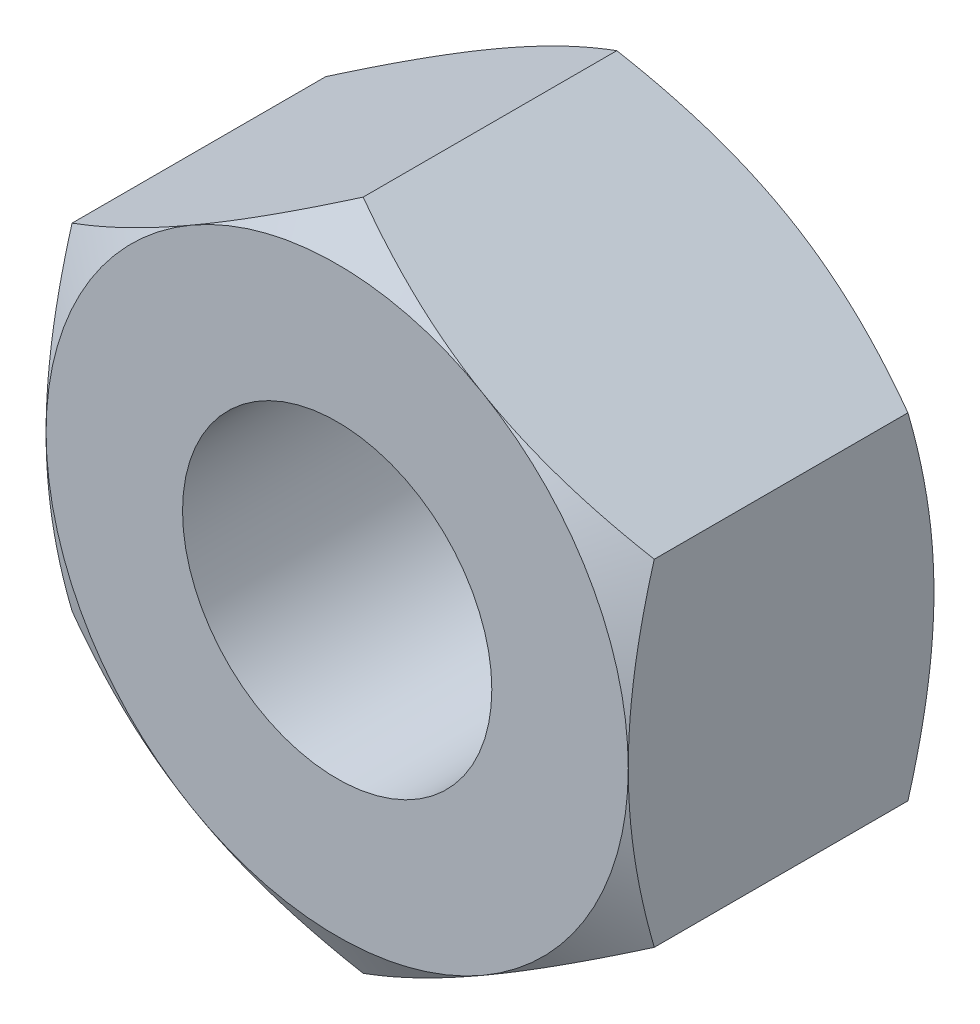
ISO-10303-21;
HEADER;
FILE_DESCRIPTION(('STEP AP214'),'2;1');
FILE_NAME('part.step','',(''),(''),'','','');
FILE_SCHEMA(('AUTOMOTIVE_DESIGN { 1 0 10303 214 1 1 1 1 }'));
ENDSEC;
DATA;
#1=APPLICATION_CONTEXT('core data for automotive mechanical design processes');
#2=APPLICATION_PROTOCOL_DEFINITION('international standard','automotive_design',2000,#1);
#3=PRODUCT_CONTEXT('',#1,'mechanical');
#4=PRODUCT('Part','Part','',(#3));
#5=PRODUCT_RELATED_PRODUCT_CATEGORY('part','',(#4));
#6=PRODUCT_DEFINITION_FORMATION('','',#4);
#7=PRODUCT_DEFINITION_CONTEXT('part definition',#1,'design');
#8=PRODUCT_DEFINITION('design','',#6,#7);
#9=PRODUCT_DEFINITION_SHAPE('','',#8);
#10=(LENGTH_UNIT() NAMED_UNIT(*) SI_UNIT(.MILLI.,.METRE.));
#11=(NAMED_UNIT(*) PLANE_ANGLE_UNIT() SI_UNIT($,.RADIAN.));
#12=(NAMED_UNIT(*) SI_UNIT($,.STERADIAN.) SOLID_ANGLE_UNIT());
#13=UNCERTAINTY_MEASURE_WITH_UNIT(LENGTH_MEASURE(1.E-05),#10,'distance_accuracy_value','');
#14=(GEOMETRIC_REPRESENTATION_CONTEXT(3) GLOBAL_UNCERTAINTY_ASSIGNED_CONTEXT((#13)) GLOBAL_UNIT_ASSIGNED_CONTEXT((#10,
#11,#12)) REPRESENTATION_CONTEXT('',''));
#15=CARTESIAN_POINT('',(0.,0.,0.));
#16=DIRECTION('',(0.,0.,1.));
#17=DIRECTION('',(1.,0.,0.));
#18=AXIS2_PLACEMENT_3D('',#15,#16,#17);
#19=CARTESIAN_POINT('',(8.,-4.618802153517,8.4));
#20=DIRECTION('',(-1.,0.,0.));
#21=DIRECTION('',(0.,-1.,0.));
#22=AXIS2_PLACEMENT_3D('',#19,#20,#21);
#23=PLANE('',#22);
#24=DIRECTION('',(0.,0.,-1.));
#25=VECTOR('',#24,1.);
#26=CARTESIAN_POINT('',(8.,4.61880215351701,8.4));
#27=LINE('',#26,#25);
#28=CARTESIAN_POINT('',(8.,4.61880215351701,7.68546882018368));
#29=VERTEX_POINT('',#28);
#30=CARTESIAN_POINT('',(8.,4.61880215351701,0.714531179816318));
#31=VERTEX_POINT('',#30);
#32=EDGE_CURVE('E150',#29,#31,#27,.T.);
#33=ORIENTED_EDGE('',*,*,#32,.F.);
#34=CARTESIAN_POINT('',(8.,-12.2497439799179,4.57178635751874));
#35=CARTESIAN_POINT('',(8.,-11.8984987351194,4.7415274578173));
#36=CARTESIAN_POINT('',(8.,-11.5464230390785,4.90958119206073));
#37=CARTESIAN_POINT('',(8.,-10.840161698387,5.24134970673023));
#38=CARTESIAN_POINT('',(8.,-10.4859757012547,5.40506373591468));
#39=CARTESIAN_POINT('',(8.,-9.77313142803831,5.72805107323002));
#40=CARTESIAN_POINT('',(8.,-9.41445915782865,5.88729360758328));
#41=CARTESIAN_POINT('',(8.,-8.69416671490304,6.1989388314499));
#42=CARTESIAN_POINT('',(8.,-8.33254669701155,6.35134187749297));
#43=CARTESIAN_POINT('',(8.,-7.60129405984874,6.64929869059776));
#44=CARTESIAN_POINT('',(8.,-7.23161757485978,6.79474539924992));
#45=CARTESIAN_POINT('',(8.,-6.48790521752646,7.07424757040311));
#46=CARTESIAN_POINT('',(8.,-6.11386886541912,7.20830176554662));
#47=CARTESIAN_POINT('',(8.,-5.36160531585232,7.46141638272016));
#48=CARTESIAN_POINT('',(8.,-4.9833889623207,7.58050868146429));
#49=CARTESIAN_POINT('',(8.,-4.22159300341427,7.79983373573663));
#50=CARTESIAN_POINT('',(8.,-3.83801513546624,7.9000724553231));
#51=CARTESIAN_POINT('',(8.,-3.06517005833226,8.07681673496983));
#52=CARTESIAN_POINT('',(8.,-2.67590136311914,8.15331597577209));
#53=CARTESIAN_POINT('',(8.,-2.0885729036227,8.24642984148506));
#54=CARTESIAN_POINT('',(8.,-1.89220175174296,8.27386398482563));
#55=CARTESIAN_POINT('',(8.,-1.49853877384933,8.3209808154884));
#56=CARTESIAN_POINT('',(8.,-1.30124704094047,8.34066427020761));
#57=CARTESIAN_POINT('',(8.,-0.907261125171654,8.37175001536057));
#58=CARTESIAN_POINT('',(8.,-0.710571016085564,8.38320372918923));
#59=CARTESIAN_POINT('',(8.,-0.316882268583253,8.39776943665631));
#60=CARTESIAN_POINT('',(8.,-0.119883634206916,8.40088153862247));
#61=CARTESIAN_POINT('',(8.,0.274012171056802,8.39868986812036));
#62=CARTESIAN_POINT('',(8.,0.470909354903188,8.39338845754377));
#63=CARTESIAN_POINT('',(8.,0.864308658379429,8.37450159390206));
#64=CARTESIAN_POINT('',(8.,1.06081075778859,8.3609157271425));
#65=CARTESIAN_POINT('',(8.,1.53707134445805,8.31823147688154));
#66=CARTESIAN_POINT('',(8.,1.81646391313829,8.28498228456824));
#67=CARTESIAN_POINT('',(8.,2.37310809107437,8.20358169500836));
#68=CARTESIAN_POINT('',(8.,2.65035909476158,8.15542623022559));
#69=CARTESIAN_POINT('',(8.,3.20249141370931,8.04592101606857));
#70=CARTESIAN_POINT('',(8.,3.4773702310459,7.98455879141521));
#71=CARTESIAN_POINT('',(8.,4.02429975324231,7.85051229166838));
#72=CARTESIAN_POINT('',(8.,4.29635072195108,7.77782908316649));
#73=CARTESIAN_POINT('',(8.,4.84432510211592,7.62097954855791));
#74=CARTESIAN_POINT('',(8.,5.1201799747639,7.53657541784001));
#75=CARTESIAN_POINT('',(8.,5.6689739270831,7.3594275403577));
#76=CARTESIAN_POINT('',(8.,5.94191487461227,7.26668954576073));
#77=CARTESIAN_POINT('',(8.,6.48378576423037,7.07478953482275));
#78=CARTESIAN_POINT('',(8.,6.7527296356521,6.97566661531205));
#79=CARTESIAN_POINT('',(8.,7.28853074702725,6.7716028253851));
#80=CARTESIAN_POINT('',(8.,7.55538709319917,6.66665960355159));
#81=CARTESIAN_POINT('',(8.,7.82127397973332,6.55938198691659));
#82=B_SPLINE_CURVE_WITH_KNOTS('',3,(#34,#35,#36,#37,#38,#39,#40,#41,#42,#43,#44,#45,#46,#47,#48,
#49,#50,#51,#52,#53,#54,#55,#56,#57,#58,#59,#60,#61,#62,#63,#64,#65,#66,#67,#68,#69,#70,#71,#72,
#73,#74,#75,#76,#77,#78,#79,#80,#81),.UNSPECIFIED.,.F.,.F.,(4,2,2,2,2,2,2,2,2,2,2,2,2,2,2,2,2,2,
2,2,2,2,2,4),(0.,1.17034358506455,2.34088846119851,3.51813189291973,4.69531388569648,
5.88694801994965,7.0787145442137,8.26789729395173,9.4567032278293,10.6458253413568,
11.2405311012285,11.8351779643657,12.4260760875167,13.0169665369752,13.6076911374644,
14.1984452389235,15.0420672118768,15.8859195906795,16.7305726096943,17.5751460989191,
18.4404219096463,19.3051050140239,20.1649211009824,21.0250871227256),.UNSPECIFIED.);
#83=CARTESIAN_POINT('',(8.,0.,8.4));
#84=VERTEX_POINT('',#83);
#85=EDGE_CURVE('E328',#29,#84,#82,.F.);
#86=ORIENTED_EDGE('',*,*,#85,.T.);
#87=CARTESIAN_POINT('',(8.,-4.618802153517,7.68546882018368));
#88=VERTEX_POINT('',#87);
#89=EDGE_CURVE('E323',#84,#88,#82,.F.);
#90=ORIENTED_EDGE('',*,*,#89,.T.);
#91=DIRECTION('',(0.,0.,-1.));
#92=VECTOR('',#91,1.);
#93=CARTESIAN_POINT('',(8.,-4.618802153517,8.4));
#94=LINE('',#93,#92);
#95=CARTESIAN_POINT('',(8.,-4.618802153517,0.714531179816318));
#96=VERTEX_POINT('',#95);
#97=EDGE_CURVE('E195',#88,#96,#94,.T.);
#98=ORIENTED_EDGE('',*,*,#97,.T.);
#99=CARTESIAN_POINT('',(8.,-12.2497439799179,3.82821364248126));
#100=CARTESIAN_POINT('',(8.,-11.8984987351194,3.6584725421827));
#101=CARTESIAN_POINT('',(8.,-11.5464230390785,3.49041880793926));
#102=CARTESIAN_POINT('',(8.,-10.840161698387,3.15865029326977));
#103=CARTESIAN_POINT('',(8.,-10.4859757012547,2.99493626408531));
#104=CARTESIAN_POINT('',(8.,-9.77313142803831,2.67194892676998));
#105=CARTESIAN_POINT('',(8.,-9.41445915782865,2.51270639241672));
#106=CARTESIAN_POINT('',(8.,-8.69416671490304,2.2010611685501));
#107=CARTESIAN_POINT('',(8.,-8.33254669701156,2.04865812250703));
#108=CARTESIAN_POINT('',(8.,-7.60129405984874,1.75070130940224));
#109=CARTESIAN_POINT('',(8.,-7.23161757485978,1.60525460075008));
#110=CARTESIAN_POINT('',(8.,-6.48790521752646,1.32575242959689));
#111=CARTESIAN_POINT('',(8.,-6.11386886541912,1.19169823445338));
#112=CARTESIAN_POINT('',(8.,-5.36160531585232,0.938583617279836));
#113=CARTESIAN_POINT('',(8.,-4.9833889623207,0.819491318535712));
#114=CARTESIAN_POINT('',(8.,-4.22159300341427,0.600166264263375));
#115=CARTESIAN_POINT('',(8.,-3.83801513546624,0.499927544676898));
#116=CARTESIAN_POINT('',(8.,-3.06517005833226,0.323183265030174));
#117=CARTESIAN_POINT('',(8.,-2.67590136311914,0.246684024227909));
#118=CARTESIAN_POINT('',(8.,-2.0885729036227,0.153570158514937));
#119=CARTESIAN_POINT('',(8.,-1.89220175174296,0.126136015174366));
#120=CARTESIAN_POINT('',(8.,-1.49853877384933,0.0790191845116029));
#121=CARTESIAN_POINT('',(8.,-1.30124704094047,0.0593357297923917));
#122=CARTESIAN_POINT('',(8.,-0.907261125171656,0.0282499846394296));
#123=CARTESIAN_POINT('',(8.,-0.710571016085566,0.0167962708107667));
#124=CARTESIAN_POINT('',(8.,-0.316882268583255,0.00223056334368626));
#125=CARTESIAN_POINT('',(8.,-0.119883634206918,-0.000881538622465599));
#126=CARTESIAN_POINT('',(8.,0.274012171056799,0.00131013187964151));
#127=CARTESIAN_POINT('',(8.,0.470909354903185,0.00661154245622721));
#128=CARTESIAN_POINT('',(8.,0.864308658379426,0.0254984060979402));
#129=CARTESIAN_POINT('',(8.,1.06081075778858,0.0390842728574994));
#130=CARTESIAN_POINT('',(8.,1.53707134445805,0.0817685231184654));
#131=CARTESIAN_POINT('',(8.,1.81646391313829,0.115017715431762));
#132=CARTESIAN_POINT('',(8.,2.37310809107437,0.196418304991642));
#133=CARTESIAN_POINT('',(8.,2.65035909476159,0.244573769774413));
#134=CARTESIAN_POINT('',(8.,3.20249141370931,0.35407898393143));
#135=CARTESIAN_POINT('',(8.,3.4773702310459,0.415441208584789));
#136=CARTESIAN_POINT('',(8.,4.02429975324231,0.549487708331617));
#137=CARTESIAN_POINT('',(8.,4.29635072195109,0.622170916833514));
#138=CARTESIAN_POINT('',(8.,4.84432510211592,0.779020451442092));
#139=CARTESIAN_POINT('',(8.,5.12017997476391,0.863424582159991));
#140=CARTESIAN_POINT('',(8.,5.66897392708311,1.0405724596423));
#141=CARTESIAN_POINT('',(8.,5.94191487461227,1.13331045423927));
#142=CARTESIAN_POINT('',(8.,6.48378576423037,1.32521046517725));
#143=CARTESIAN_POINT('',(8.,6.75272963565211,1.42433338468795));
#144=CARTESIAN_POINT('',(8.,7.28853074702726,1.6283971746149));
#145=CARTESIAN_POINT('',(8.,7.55538709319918,1.73334039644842));
#146=CARTESIAN_POINT('',(8.,7.82127397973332,1.84061801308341));
#147=B_SPLINE_CURVE_WITH_KNOTS('',3,(#99,#100,#101,#102,#103,#104,#105,#106,#107,#108,#109,#110,
#111,#112,#113,#114,#115,#116,#117,#118,#119,#120,#121,#122,#123,#124,#125,#126,#127,#128,#129,
#130,#131,#132,#133,#134,#135,#136,#137,#138,#139,#140,#141,#142,#143,#144,#145,#146),
.UNSPECIFIED.,.F.,.F.,(4,2,2,2,2,2,2,2,2,2,2,2,2,2,2,2,2,2,2,2,2,2,2,4),(0.,1.17034358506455,
2.34088846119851,3.51813189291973,4.69531388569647,5.88694801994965,7.07871454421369,
8.26789729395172,9.4567032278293,10.6458253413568,11.2405311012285,11.8351779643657,
12.4260760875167,13.0169665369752,13.6076911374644,14.1984452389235,15.0420672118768,
15.8859195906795,16.7305726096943,17.5751460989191,18.4404219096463,19.3051050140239,
20.1649211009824,21.0250871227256),.UNSPECIFIED.);
#148=CARTESIAN_POINT('',(8.,0.,0.));
#149=VERTEX_POINT('',#148);
#150=EDGE_CURVE('E181',#96,#149,#147,.T.);
#151=ORIENTED_EDGE('',*,*,#150,.T.);
#152=EDGE_CURVE('E192',#149,#31,#147,.T.);
#153=ORIENTED_EDGE('',*,*,#152,.T.);
#154=EDGE_LOOP('',(#33,#86,#90,#98,#151,#153));
#155=FACE_BOUND('',#154,.T.);
#156=ADVANCED_FACE('F30',(#155),#23,.F.);
#157=CARTESIAN_POINT('',(8.,4.61880215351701,8.4));
#158=DIRECTION('',(-0.5,-0.866025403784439,0.));
#159=DIRECTION('',(0.866025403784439,-0.5,0.));
#160=AXIS2_PLACEMENT_3D('',#157,#158,#159);
#161=PLANE('',#160);
#162=DIRECTION('',(0.,0.,-1.));
#163=VECTOR('',#162,1.);
#164=CARTESIAN_POINT('',(0.,9.23760430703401,8.4));
#165=LINE('',#164,#163);
#166=CARTESIAN_POINT('',(0.,9.23760430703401,7.68546882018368));
#167=VERTEX_POINT('',#166);
#168=CARTESIAN_POINT('',(0.,9.23760430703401,0.714531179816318));
#169=VERTEX_POINT('',#168);
#170=EDGE_CURVE('E147',#167,#169,#165,.T.);
#171=ORIENTED_EDGE('',*,*,#170,.F.);
#172=CARTESIAN_POINT('',(-0.000199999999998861,9.23771977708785,7.68540215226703));
#173=CARTESIAN_POINT('',(0.175648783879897,9.13619343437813,7.74400928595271));
#174=CARTESIAN_POINT('',(0.352153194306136,9.03428856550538,7.79995659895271));
#175=CARTESIAN_POINT('',(0.70659546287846,8.82965122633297,7.90579899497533));
#176=CARTESIAN_POINT('',(0.884533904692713,8.72691841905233,7.95569146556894));
#177=CARTESIAN_POINT('',(1.42119823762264,8.41707512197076,8.09530720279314));
#178=CARTESIAN_POINT('',(1.78204258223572,8.20874154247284,8.17471882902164));
#179=CARTESIAN_POINT('',(2.32203917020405,7.89697436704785,8.26783835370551));
#180=CARTESIAN_POINT('',(2.49957818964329,7.79447216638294,8.29436541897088));
#181=CARTESIAN_POINT('',(2.8554591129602,7.58900421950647,8.33884682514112));
#182=CARTESIAN_POINT('',(3.03380094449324,7.4860385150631,8.35680192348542));
#183=CARTESIAN_POINT('',(3.3907916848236,7.27992981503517,8.38368435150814));
#184=CARTESIAN_POINT('',(3.5694400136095,7.17678715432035,8.39262192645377));
#185=CARTESIAN_POINT('',(3.92690170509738,6.97040655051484,8.40127769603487));
#186=CARTESIAN_POINT('',(4.10571506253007,6.86716861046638,8.40099617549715));
#187=CARTESIAN_POINT('',(4.44001336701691,6.67416139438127,8.39185497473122));
#188=CARTESIAN_POINT('',(4.59552190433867,6.58437849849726,8.38411039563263));
#189=CARTESIAN_POINT('',(4.90617476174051,6.40502298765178,8.36179886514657));
#190=CARTESIAN_POINT('',(5.06131905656,6.31545038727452,8.34723145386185));
#191=CARTESIAN_POINT('',(5.52615131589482,6.04707935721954,8.29363930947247));
#192=CARTESIAN_POINT('',(5.83501648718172,5.86875596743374,8.24473135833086));
#193=CARTESIAN_POINT('',(6.4560232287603,5.51021755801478,8.12246059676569));
#194=CARTESIAN_POINT('',(6.76808554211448,5.33004829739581,8.04857947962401));
#195=CARTESIAN_POINT('',(7.38755648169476,4.97239658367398,7.88089985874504));
#196=CARTESIAN_POINT('',(7.69497304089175,4.79490955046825,7.78714073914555));
#197=CARTESIAN_POINT('',(8.0002,4.61868668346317,7.68540215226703));
#198=B_SPLINE_CURVE_WITH_KNOTS('',3,(#172,#173,#174,#175,#176,#177,#178,#179,#180,#181,#182,
#183,#184,#185,#186,#187,#188,#189,#190,#191,#192,#193,#194,#195,#196,#197),.UNSPECIFIED.,.F.,
.F.,(4,2,2,2,2,2,2,2,2,2,2,2,4),(0.,0.633973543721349,1.26821965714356,2.53934712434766,
3.15934343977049,3.77928496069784,4.39852133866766,5.01773858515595,5.55680239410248,
6.09590254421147,7.17487077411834,8.27776850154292,9.37850115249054),.UNSPECIFIED.);
#199=CARTESIAN_POINT('',(4.,6.92820323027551,8.4));
#200=VERTEX_POINT('',#199);
#201=EDGE_CURVE('E140',#167,#200,#198,.T.);
#202=ORIENTED_EDGE('',*,*,#201,.T.);
#203=EDGE_CURVE('E257',#200,#29,#198,.T.);
#204=ORIENTED_EDGE('',*,*,#203,.T.);
#205=ORIENTED_EDGE('',*,*,#32,.T.);
#206=CARTESIAN_POINT('',(8.0002,4.61868668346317,0.71459784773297));
#207=CARTESIAN_POINT('',(7.8243512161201,4.7202130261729,0.655990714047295));
#208=CARTESIAN_POINT('',(7.64784680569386,4.82211789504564,0.600043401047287));
#209=CARTESIAN_POINT('',(7.29340453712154,5.02675523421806,0.494201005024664));
#210=CARTESIAN_POINT('',(7.11546609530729,5.1294880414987,0.444308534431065));
#211=CARTESIAN_POINT('',(6.57880176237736,5.43933133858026,0.304692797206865));
#212=CARTESIAN_POINT('',(6.21795741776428,5.64766491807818,0.225281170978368));
#213=CARTESIAN_POINT('',(5.67796082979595,5.95943209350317,0.132161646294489));
#214=CARTESIAN_POINT('',(5.50042181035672,6.06193429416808,0.105634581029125));
#215=CARTESIAN_POINT('',(5.1445408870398,6.26740224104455,0.0611531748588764));
#216=CARTESIAN_POINT('',(4.96619905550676,6.37036794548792,0.0431980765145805));
#217=CARTESIAN_POINT('',(4.60920831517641,6.57647664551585,0.0163156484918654));
#218=CARTESIAN_POINT('',(4.4305599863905,6.67961930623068,0.00737807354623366));
#219=CARTESIAN_POINT('',(4.07309829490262,6.88599991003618,-0.00127769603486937));
#220=CARTESIAN_POINT('',(3.89428493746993,6.98923785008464,-0.000996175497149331));
#221=CARTESIAN_POINT('',(3.5599866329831,7.18224506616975,0.00814502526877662));
#222=CARTESIAN_POINT('',(3.40447809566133,7.27202796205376,0.0158896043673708));
#223=CARTESIAN_POINT('',(3.09382523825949,7.45138347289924,0.0382011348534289));
#224=CARTESIAN_POINT('',(2.93868094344,7.54095607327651,0.0527685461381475));
#225=CARTESIAN_POINT('',(2.47384868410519,7.80932710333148,0.106360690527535));
#226=CARTESIAN_POINT('',(2.16498351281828,7.98765049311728,0.155268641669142));
#227=CARTESIAN_POINT('',(1.5439767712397,8.34618890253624,0.27753940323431));
#228=CARTESIAN_POINT('',(1.23191445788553,8.52635816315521,0.351420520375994));
#229=CARTESIAN_POINT('',(0.612443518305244,8.88400987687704,0.519100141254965));
#230=CARTESIAN_POINT('',(0.305026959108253,9.06149691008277,0.612859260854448));
#231=CARTESIAN_POINT('',(-0.000199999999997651,9.23771977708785,0.714597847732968));
#232=B_SPLINE_CURVE_WITH_KNOTS('',3,(#206,#207,#208,#209,#210,#211,#212,#213,#214,#215,#216,
#217,#218,#219,#220,#221,#222,#223,#224,#225,#226,#227,#228,#229,#230,#231),.UNSPECIFIED.,.F.,
.F.,(4,2,2,2,2,2,2,2,2,2,2,2,4),(0.,0.63397354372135,1.26821965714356,2.53934712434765,
3.15934343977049,3.77928496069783,4.39852133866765,5.01773858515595,5.55680239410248,
6.09590254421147,7.17487077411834,8.27776850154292,9.37850115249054),.UNSPECIFIED.);
#233=CARTESIAN_POINT('',(4.,6.92820323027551,0.));
#234=VERTEX_POINT('',#233);
#235=EDGE_CURVE('E198',#31,#234,#232,.T.);
#236=ORIENTED_EDGE('',*,*,#235,.T.);
#237=EDGE_CURVE('E204',#234,#169,#232,.T.);
#238=ORIENTED_EDGE('',*,*,#237,.T.);
#239=EDGE_LOOP('',(#171,#202,#204,#205,#236,#238));
#240=FACE_BOUND('',#239,.T.);
#241=ADVANCED_FACE('F249',(#240),#161,.F.);
#242=CARTESIAN_POINT('',(0.,9.23760430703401,8.4));
#243=DIRECTION('',(0.5,-0.866025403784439,0.));
#244=DIRECTION('',(0.866025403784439,0.5,0.));
#245=AXIS2_PLACEMENT_3D('',#242,#243,#244);
#246=PLANE('',#245);
#247=DIRECTION('',(0.,0.,-1.));
#248=VECTOR('',#247,1.);
#249=CARTESIAN_POINT('',(-8.,4.618802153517,8.4));
#250=LINE('',#249,#248);
#251=CARTESIAN_POINT('',(-8.,4.61880215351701,7.68546882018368));
#252=VERTEX_POINT('',#251);
#253=CARTESIAN_POINT('',(-8.,4.61880215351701,0.714531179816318));
#254=VERTEX_POINT('',#253);
#255=EDGE_CURVE('E137',#252,#254,#250,.T.);
#256=ORIENTED_EDGE('',*,*,#255,.F.);
#257=CARTESIAN_POINT('',(-8.0002,4.61868668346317,7.68540215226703));
#258=CARTESIAN_POINT('',(-7.8243512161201,4.72021302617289,7.74400928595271));
#259=CARTESIAN_POINT('',(-7.64784680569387,4.82211789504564,7.79995659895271));
#260=CARTESIAN_POINT('',(-7.29340453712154,5.02675523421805,7.90579899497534));
#261=CARTESIAN_POINT('',(-7.11546609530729,5.12948804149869,7.95569146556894));
#262=CARTESIAN_POINT('',(-6.57880176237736,5.43933133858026,8.09530720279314));
#263=CARTESIAN_POINT('',(-6.21795741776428,5.64766491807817,8.17471882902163));
#264=CARTESIAN_POINT('',(-5.67796082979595,5.95943209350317,8.26783835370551));
#265=CARTESIAN_POINT('',(-5.50042181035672,6.06193429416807,8.29436541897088));
#266=CARTESIAN_POINT('',(-5.1445408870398,6.26740224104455,8.33884682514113));
#267=CARTESIAN_POINT('',(-4.96619905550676,6.37036794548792,8.35680192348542));
#268=CARTESIAN_POINT('',(-4.60920831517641,6.57647664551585,8.38368435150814));
#269=CARTESIAN_POINT('',(-4.4305599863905,6.67961930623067,8.39262192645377));
#270=CARTESIAN_POINT('',(-4.07309829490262,6.88599991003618,8.40127769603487));
#271=CARTESIAN_POINT('',(-3.89428493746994,6.98923785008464,8.40099617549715));
#272=CARTESIAN_POINT('',(-3.5599866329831,7.18224506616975,8.39185497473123));
#273=CARTESIAN_POINT('',(-3.40447809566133,7.27202796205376,8.38411039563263));
#274=CARTESIAN_POINT('',(-3.09382523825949,7.45138347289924,8.36179886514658));
#275=CARTESIAN_POINT('',(-2.93868094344,7.5409560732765,8.34723145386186));
#276=CARTESIAN_POINT('',(-2.47384868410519,7.80932710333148,8.29363930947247));
#277=CARTESIAN_POINT('',(-2.16498351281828,7.98765049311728,8.24473135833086));
#278=CARTESIAN_POINT('',(-1.5439767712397,8.34618890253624,8.12246059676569));
#279=CARTESIAN_POINT('',(-1.23191445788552,8.52635816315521,8.04857947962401));
#280=CARTESIAN_POINT('',(-0.612443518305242,8.88400987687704,7.88089985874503));
#281=CARTESIAN_POINT('',(-0.305026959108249,9.06149691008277,7.78714073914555));
#282=CARTESIAN_POINT('',(0.000200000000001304,9.23771977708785,7.68540215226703));
#283=B_SPLINE_CURVE_WITH_KNOTS('',3,(#257,#258,#259,#260,#261,#262,#263,#264,#265,#266,#267,
#268,#269,#270,#271,#272,#273,#274,#275,#276,#277,#278,#279,#280,#281,#282),.UNSPECIFIED.,.F.,
.F.,(4,2,2,2,2,2,2,2,2,2,2,2,4),(0.,0.633973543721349,1.26821965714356,2.53934712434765,
3.15934343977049,3.77928496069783,4.39852133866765,5.01773858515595,5.55680239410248,
6.09590254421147,7.17487077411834,8.27776850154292,9.37850115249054),.UNSPECIFIED.);
#284=CARTESIAN_POINT('',(-4.,6.92820323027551,8.4));
#285=VERTEX_POINT('',#284);
#286=EDGE_CURVE('E119',#252,#285,#283,.T.);
#287=ORIENTED_EDGE('',*,*,#286,.T.);
#288=EDGE_CURVE('E130',#285,#167,#283,.T.);
#289=ORIENTED_EDGE('',*,*,#288,.T.);
#290=ORIENTED_EDGE('',*,*,#170,.T.);
#291=CARTESIAN_POINT('',(0.000200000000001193,9.23771977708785,0.71459784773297));
#292=CARTESIAN_POINT('',(-0.175648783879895,9.13619343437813,0.655990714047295));
#293=CARTESIAN_POINT('',(-0.352153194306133,9.03428856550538,0.600043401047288));
#294=CARTESIAN_POINT('',(-0.706595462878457,8.82965122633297,0.494201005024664));
#295=CARTESIAN_POINT('',(-0.884533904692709,8.72691841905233,0.444308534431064));
#296=CARTESIAN_POINT('',(-1.42119823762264,8.41707512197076,0.304692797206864));
#297=CARTESIAN_POINT('',(-1.78204258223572,8.20874154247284,0.225281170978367));
#298=CARTESIAN_POINT('',(-2.32203917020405,7.89697436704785,0.132161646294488));
#299=CARTESIAN_POINT('',(-2.49957818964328,7.79447216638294,0.105634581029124));
#300=CARTESIAN_POINT('',(-2.8554591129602,7.58900421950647,0.0611531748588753));
#301=CARTESIAN_POINT('',(-3.03380094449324,7.4860385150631,0.0431980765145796));
#302=CARTESIAN_POINT('',(-3.39079168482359,7.27992981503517,0.0163156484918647));
#303=CARTESIAN_POINT('',(-3.5694400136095,7.17678715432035,0.00737807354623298));
#304=CARTESIAN_POINT('',(-3.92690170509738,6.97040655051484,-0.00127769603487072));
#305=CARTESIAN_POINT('',(-4.10571506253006,6.86716861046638,-0.000996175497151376));
#306=CARTESIAN_POINT('',(-4.4400133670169,6.67416139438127,0.00814502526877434));
#307=CARTESIAN_POINT('',(-4.59552190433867,6.58437849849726,0.0158896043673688));
#308=CARTESIAN_POINT('',(-4.90617476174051,6.40502298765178,0.0382011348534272));
#309=CARTESIAN_POINT('',(-5.06131905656,6.31545038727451,0.0527685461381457));
#310=CARTESIAN_POINT('',(-5.52615131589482,6.04707935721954,0.106360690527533));
#311=CARTESIAN_POINT('',(-5.83501648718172,5.86875596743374,0.155268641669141));
#312=CARTESIAN_POINT('',(-6.4560232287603,5.51021755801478,0.27753940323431));
#313=CARTESIAN_POINT('',(-6.76808554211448,5.3300482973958,0.351420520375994));
#314=CARTESIAN_POINT('',(-7.38755648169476,4.97239658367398,0.519100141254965));
#315=CARTESIAN_POINT('',(-7.69497304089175,4.79490955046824,0.612859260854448));
#316=CARTESIAN_POINT('',(-8.0002,4.61868668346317,0.714597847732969));
#317=B_SPLINE_CURVE_WITH_KNOTS('',3,(#291,#292,#293,#294,#295,#296,#297,#298,#299,#300,#301,
#302,#303,#304,#305,#306,#307,#308,#309,#310,#311,#312,#313,#314,#315,#316),.UNSPECIFIED.,.F.,
.F.,(4,2,2,2,2,2,2,2,2,2,2,2,4),(0.,0.633973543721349,1.26821965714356,2.53934712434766,
3.15934343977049,3.77928496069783,4.39852133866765,5.01773858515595,5.55680239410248,
6.09590254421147,7.17487077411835,8.27776850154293,9.37850115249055),.UNSPECIFIED.);
#318=CARTESIAN_POINT('',(-4.,6.92820323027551,0.));
#319=VERTEX_POINT('',#318);
#320=EDGE_CURVE('E245',#169,#319,#317,.T.);
#321=ORIENTED_EDGE('',*,*,#320,.T.);
#322=EDGE_CURVE('E146',#319,#254,#317,.T.);
#323=ORIENTED_EDGE('',*,*,#322,.T.);
#324=EDGE_LOOP('',(#256,#287,#289,#290,#321,#323));
#325=FACE_BOUND('',#324,.T.);
#326=ADVANCED_FACE('F143',(#325),#246,.F.);
#327=CARTESIAN_POINT('',(-8.,4.618802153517,8.4));
#328=DIRECTION('',(1.,0.,0.));
#329=DIRECTION('',(0.,0.,-1.));
#330=AXIS2_PLACEMENT_3D('',#327,#328,#329);
#331=PLANE('',#330);
#332=DIRECTION('',(0.,0.,-1.));
#333=VECTOR('',#332,1.);
#334=CARTESIAN_POINT('',(-8.,-4.618802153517,8.4));
#335=LINE('',#334,#333);
#336=CARTESIAN_POINT('',(-8.,-4.618802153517,7.68546882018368));
#337=VERTEX_POINT('',#336);
#338=CARTESIAN_POINT('',(-8.,-4.618802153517,0.714531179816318));
#339=VERTEX_POINT('',#338);
#340=EDGE_CURVE('E148',#337,#339,#335,.T.);
#341=ORIENTED_EDGE('',*,*,#340,.F.);
#342=CARTESIAN_POINT('',(-8.,-12.2497439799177,4.57178635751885));
#343=CARTESIAN_POINT('',(-8.,-11.8984987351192,4.74152745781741));
#344=CARTESIAN_POINT('',(-8.,-11.5464230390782,4.90958119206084));
#345=CARTESIAN_POINT('',(-8.,-10.8401616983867,5.24134970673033));
#346=CARTESIAN_POINT('',(-8.,-10.4859757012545,5.40506373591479));
#347=CARTESIAN_POINT('',(-8.,-9.7731314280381,5.72805107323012));
#348=CARTESIAN_POINT('',(-8.,-9.41445915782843,5.88729360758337));
#349=CARTESIAN_POINT('',(-8.,-8.69416671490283,6.19893883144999));
#350=CARTESIAN_POINT('',(-8.,-8.33254669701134,6.35134187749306));
#351=CARTESIAN_POINT('',(-8.,-7.60129405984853,6.64929869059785));
#352=CARTESIAN_POINT('',(-8.,-7.23161757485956,6.79474539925));
#353=CARTESIAN_POINT('',(-8.,-6.48790521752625,7.07424757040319));
#354=CARTESIAN_POINT('',(-8.,-6.11386886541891,7.20830176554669));
#355=CARTESIAN_POINT('',(-8.,-5.36160531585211,7.46141638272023));
#356=CARTESIAN_POINT('',(-8.,-4.98338896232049,7.58050868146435));
#357=CARTESIAN_POINT('',(-8.,-4.22159300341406,7.79983373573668));
#358=CARTESIAN_POINT('',(-8.,-3.83801513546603,7.90007245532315));
#359=CARTESIAN_POINT('',(-8.,-3.06517005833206,8.07681673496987));
#360=CARTESIAN_POINT('',(-8.,-2.67590136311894,8.15331597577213));
#361=CARTESIAN_POINT('',(-8.,-2.0885729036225,8.24642984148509));
#362=CARTESIAN_POINT('',(-8.,-1.89220175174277,8.27386398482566));
#363=CARTESIAN_POINT('',(-8.,-1.49853877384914,8.32098081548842));
#364=CARTESIAN_POINT('',(-8.,-1.30124704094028,8.34066427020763));
#365=CARTESIAN_POINT('',(-8.,-0.907261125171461,8.37175001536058));
#366=CARTESIAN_POINT('',(-8.,-0.710571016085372,8.38320372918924));
#367=CARTESIAN_POINT('',(-8.,-0.316882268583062,8.39776943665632));
#368=CARTESIAN_POINT('',(-8.,-0.119883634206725,8.40088153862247));
#369=CARTESIAN_POINT('',(-8.,0.274012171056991,8.39868986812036));
#370=CARTESIAN_POINT('',(-8.,0.470909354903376,8.39338845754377));
#371=CARTESIAN_POINT('',(-8.,0.864308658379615,8.37450159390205));
#372=CARTESIAN_POINT('',(-8.,1.06081075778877,8.36091572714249));
#373=CARTESIAN_POINT('',(-8.,1.53707134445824,8.31823147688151));
#374=CARTESIAN_POINT('',(-8.,1.81646391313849,8.28498228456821));
#375=CARTESIAN_POINT('',(-8.,2.37310809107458,8.20358169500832));
#376=CARTESIAN_POINT('',(-8.,2.6503590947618,8.15542623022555));
#377=CARTESIAN_POINT('',(-8.,3.20249141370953,8.04592101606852));
#378=CARTESIAN_POINT('',(-8.,3.47737023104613,7.98455879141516));
#379=CARTESIAN_POINT('',(-8.,4.02429975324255,7.85051229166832));
#380=CARTESIAN_POINT('',(-8.,4.29635072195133,7.77782908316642));
#381=CARTESIAN_POINT('',(-8.,4.84432510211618,7.62097954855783));
#382=CARTESIAN_POINT('',(-8.,5.12017997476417,7.53657541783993));
#383=CARTESIAN_POINT('',(-8.,5.66897392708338,7.3594275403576));
#384=CARTESIAN_POINT('',(-8.,5.94191487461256,7.26668954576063));
#385=CARTESIAN_POINT('',(-8.,6.48378576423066,7.07478953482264));
#386=CARTESIAN_POINT('',(-8.,6.7527296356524,6.97566661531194));
#387=CARTESIAN_POINT('',(-8.,7.28853074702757,6.77160282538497));
#388=CARTESIAN_POINT('',(-8.,7.55538709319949,6.66665960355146));
#389=CARTESIAN_POINT('',(-8.,7.82127397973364,6.55938198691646));
#390=B_SPLINE_CURVE_WITH_KNOTS('',3,(#342,#343,#344,#345,#346,#347,#348,#349,#350,#351,#352,
#353,#354,#355,#356,#357,#358,#359,#360,#361,#362,#363,#364,#365,#366,#367,#368,#369,#370,#371,
#372,#373,#374,#375,#376,#377,#378,#379,#380,#381,#382,#383,#384,#385,#386,#387,#388,#389),
.UNSPECIFIED.,.F.,.F.,(4,2,2,2,2,2,2,2,2,2,2,2,2,2,2,2,2,2,2,2,2,2,2,4),(0.,1.17034358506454,
2.34088846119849,3.51813189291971,4.69531388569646,5.88694801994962,7.07871454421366,
8.26789729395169,9.45670322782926,10.6458253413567,11.2405311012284,11.8351779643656,
12.4260760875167,13.0169665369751,13.6076911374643,14.1984452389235,15.0420672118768,
15.8859195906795,16.7305726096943,17.5751460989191,18.4404219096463,19.305105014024,
20.1649211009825,21.0250871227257),.UNSPECIFIED.);
#391=CARTESIAN_POINT('',(-8.,0.,8.4));
#392=VERTEX_POINT('',#391);
#393=EDGE_CURVE('E139',#337,#392,#390,.T.);
#394=ORIENTED_EDGE('',*,*,#393,.T.);
#395=EDGE_CURVE('E122',#392,#252,#390,.T.);
#396=ORIENTED_EDGE('',*,*,#395,.T.);
#397=ORIENTED_EDGE('',*,*,#255,.T.);
#398=CARTESIAN_POINT('',(-8.,-12.2497439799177,3.82821364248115));
#399=CARTESIAN_POINT('',(-8.,-11.8984987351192,3.65847254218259));
#400=CARTESIAN_POINT('',(-8.,-11.5464230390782,3.49041880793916));
#401=CARTESIAN_POINT('',(-8.,-10.8401616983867,3.15865029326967));
#402=CARTESIAN_POINT('',(-8.,-10.4859757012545,2.99493626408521));
#403=CARTESIAN_POINT('',(-8.,-9.77313142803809,2.67194892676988));
#404=CARTESIAN_POINT('',(-8.,-9.41445915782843,2.51270639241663));
#405=CARTESIAN_POINT('',(-8.,-8.69416671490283,2.20106116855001));
#406=CARTESIAN_POINT('',(-8.,-8.33254669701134,2.04865812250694));
#407=CARTESIAN_POINT('',(-8.,-7.60129405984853,1.75070130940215));
#408=CARTESIAN_POINT('',(-8.,-7.23161757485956,1.60525460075));
#409=CARTESIAN_POINT('',(-8.,-6.48790521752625,1.32575242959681));
#410=CARTESIAN_POINT('',(-8.,-6.11386886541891,1.19169823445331));
#411=CARTESIAN_POINT('',(-8.,-5.36160531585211,0.93858361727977));
#412=CARTESIAN_POINT('',(-8.,-4.98338896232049,0.819491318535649));
#413=CARTESIAN_POINT('',(-8.,-4.22159300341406,0.600166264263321));
#414=CARTESIAN_POINT('',(-8.,-3.83801513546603,0.499927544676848));
#415=CARTESIAN_POINT('',(-8.,-3.06517005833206,0.323183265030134));
#416=CARTESIAN_POINT('',(-8.,-2.67590136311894,0.246684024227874));
#417=CARTESIAN_POINT('',(-8.,-2.0885729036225,0.153570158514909));
#418=CARTESIAN_POINT('',(-8.,-1.89220175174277,0.12613601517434));
#419=CARTESIAN_POINT('',(-8.,-1.49853877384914,0.0790191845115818));
#420=CARTESIAN_POINT('',(-8.,-1.30124704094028,0.0593357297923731));
#421=CARTESIAN_POINT('',(-8.,-0.907261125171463,0.0282499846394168));
#422=CARTESIAN_POINT('',(-8.,-0.710571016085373,0.0167962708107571));
#423=CARTESIAN_POINT('',(-8.,-0.316882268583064,0.00223056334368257));
#424=CARTESIAN_POINT('',(-8.,-0.119883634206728,-0.000881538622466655));
#425=CARTESIAN_POINT('',(-8.,0.274012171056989,0.0013101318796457));
#426=CARTESIAN_POINT('',(-8.,0.470909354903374,0.00661154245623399));
#427=CARTESIAN_POINT('',(-8.,0.864308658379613,0.0254984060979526));
#428=CARTESIAN_POINT('',(-8.,1.06081075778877,0.0390842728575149));
#429=CARTESIAN_POINT('',(-8.,1.53707134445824,0.0817685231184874));
#430=CARTESIAN_POINT('',(-8.,1.81646391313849,0.115017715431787));
#431=CARTESIAN_POINT('',(-8.,2.37310809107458,0.196418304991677));
#432=CARTESIAN_POINT('',(-8.,2.65035909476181,0.244573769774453));
#433=CARTESIAN_POINT('',(-8.,3.20249141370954,0.354078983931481));
#434=CARTESIAN_POINT('',(-8.,3.47737023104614,0.415441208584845));
#435=CARTESIAN_POINT('',(-8.,4.02429975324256,0.549487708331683));
#436=CARTESIAN_POINT('',(-8.,4.29635072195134,0.622170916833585));
#437=CARTESIAN_POINT('',(-8.,4.84432510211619,0.779020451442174));
#438=CARTESIAN_POINT('',(-8.,5.12017997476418,0.863424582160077));
#439=CARTESIAN_POINT('',(-8.,5.66897392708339,1.0405724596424));
#440=CARTESIAN_POINT('',(-8.,5.94191487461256,1.13331045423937));
#441=CARTESIAN_POINT('',(-8.,6.48378576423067,1.32521046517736));
#442=CARTESIAN_POINT('',(-8.,6.75272963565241,1.42433338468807));
#443=CARTESIAN_POINT('',(-8.,7.28853074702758,1.62839717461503));
#444=CARTESIAN_POINT('',(-8.,7.5553870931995,1.73334039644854));
#445=CARTESIAN_POINT('',(-8.,7.82127397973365,1.84061801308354));
#446=B_SPLINE_CURVE_WITH_KNOTS('',3,(#398,#399,#400,#401,#402,#403,#404,#405,#406,#407,#408,
#409,#410,#411,#412,#413,#414,#415,#416,#417,#418,#419,#420,#421,#422,#423,#424,#425,#426,#427,
#428,#429,#430,#431,#432,#433,#434,#435,#436,#437,#438,#439,#440,#441,#442,#443,#444,#445),
.UNSPECIFIED.,.F.,.F.,(4,2,2,2,2,2,2,2,2,2,2,2,2,2,2,2,2,2,2,2,2,2,2,4),(0.,1.17034358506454,
2.3408884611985,3.51813189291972,4.69531388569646,5.88694801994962,7.07871454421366,
8.26789729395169,9.45670322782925,10.6458253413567,11.2405311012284,11.8351779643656,
12.4260760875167,13.0169665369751,13.6076911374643,14.1984452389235,15.0420672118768,
15.8859195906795,16.7305726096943,17.5751460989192,18.4404219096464,19.305105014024,
20.1649211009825,21.0250871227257),.UNSPECIFIED.);
#447=CARTESIAN_POINT('',(-8.,0.,0.));
#448=VERTEX_POINT('',#447);
#449=EDGE_CURVE('E246',#254,#448,#446,.F.);
#450=ORIENTED_EDGE('',*,*,#449,.T.);
#451=EDGE_CURVE('E236',#448,#339,#446,.F.);
#452=ORIENTED_EDGE('',*,*,#451,.T.);
#453=EDGE_LOOP('',(#341,#394,#396,#397,#450,#452));
#454=FACE_BOUND('',#453,.T.);
#455=ADVANCED_FACE('F135',(#454),#331,.F.);
#456=CARTESIAN_POINT('',(-8.,-4.618802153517,8.4));
#457=DIRECTION('',(0.5,0.866025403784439,0.));
#458=DIRECTION('',(-0.866025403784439,0.5,0.));
#459=AXIS2_PLACEMENT_3D('',#456,#457,#458);
#460=PLANE('',#459);
#461=DIRECTION('',(0.,0.,-1.));
#462=VECTOR('',#461,1.);
#463=CARTESIAN_POINT('',(0.,-9.23760430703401,8.4));
#464=LINE('',#463,#462);
#465=CARTESIAN_POINT('',(0.,-9.23760430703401,7.68546882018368));
#466=VERTEX_POINT('',#465);
#467=CARTESIAN_POINT('',(0.,-9.23760430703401,0.714531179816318));
#468=VERTEX_POINT('',#467);
#469=EDGE_CURVE('E152',#466,#468,#464,.T.);
#470=ORIENTED_EDGE('',*,*,#469,.F.);
#471=CARTESIAN_POINT('',(0.000199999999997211,-9.23771977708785,7.68540215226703));
#472=CARTESIAN_POINT('',(-0.175648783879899,-9.13619343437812,7.74400928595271));
#473=CARTESIAN_POINT('',(-0.352153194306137,-9.03428856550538,7.79995659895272));
#474=CARTESIAN_POINT('',(-0.706595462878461,-8.82965122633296,7.90579899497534));
#475=CARTESIAN_POINT('',(-0.884533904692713,-8.72691841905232,7.95569146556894));
#476=CARTESIAN_POINT('',(-1.42119823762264,-8.41707512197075,8.09530720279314));
#477=CARTESIAN_POINT('',(-1.78204258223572,-8.20874154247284,8.17471882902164));
#478=CARTESIAN_POINT('',(-2.32203917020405,-7.89697436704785,8.26783835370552));
#479=CARTESIAN_POINT('',(-2.49957818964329,-7.79447216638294,8.29436541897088));
#480=CARTESIAN_POINT('',(-2.8554591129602,-7.58900421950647,8.33884682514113));
#481=CARTESIAN_POINT('',(-3.03380094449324,-7.4860385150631,8.35680192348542));
#482=CARTESIAN_POINT('',(-3.39079168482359,-7.27992981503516,8.38368435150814));
#483=CARTESIAN_POINT('',(-3.5694400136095,-7.17678715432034,8.39262192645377));
#484=CARTESIAN_POINT('',(-3.92690170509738,-6.97040655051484,8.40127769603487));
#485=CARTESIAN_POINT('',(-4.10571506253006,-6.86716861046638,8.40099617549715));
#486=CARTESIAN_POINT('',(-4.4400133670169,-6.67416139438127,8.39185497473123));
#487=CARTESIAN_POINT('',(-4.59552190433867,-6.58437849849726,8.38411039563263));
#488=CARTESIAN_POINT('',(-4.90617476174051,-6.40502298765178,8.36179886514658));
#489=CARTESIAN_POINT('',(-5.06131905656,-6.31545038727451,8.34723145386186));
#490=CARTESIAN_POINT('',(-5.52615131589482,-6.04707935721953,8.29363930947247));
#491=CARTESIAN_POINT('',(-5.83501648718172,-5.86875596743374,8.24473135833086));
#492=CARTESIAN_POINT('',(-6.4560232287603,-5.51021755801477,8.12246059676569));
#493=CARTESIAN_POINT('',(-6.76808554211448,-5.3300482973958,8.04857947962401));
#494=CARTESIAN_POINT('',(-7.38755648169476,-4.97239658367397,7.88089985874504));
#495=CARTESIAN_POINT('',(-7.69497304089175,-4.79490955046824,7.78714073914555));
#496=CARTESIAN_POINT('',(-8.0002,-4.61868668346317,7.68540215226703));
#497=B_SPLINE_CURVE_WITH_KNOTS('',3,(#471,#472,#473,#474,#475,#476,#477,#478,#479,#480,#481,
#482,#483,#484,#485,#486,#487,#488,#489,#490,#491,#492,#493,#494,#495,#496),.UNSPECIFIED.,.F.,
.F.,(4,2,2,2,2,2,2,2,2,2,2,2,4),(0.,0.633973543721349,1.26821965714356,2.53934712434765,
3.15934343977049,3.77928496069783,4.39852133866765,5.01773858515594,5.55680239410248,
6.09590254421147,7.17487077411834,8.27776850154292,9.37850115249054),.UNSPECIFIED.);
#498=CARTESIAN_POINT('',(-4.,-6.92820323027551,8.4));
#499=VERTEX_POINT('',#498);
#500=EDGE_CURVE('E52',#466,#499,#497,.T.);
#501=ORIENTED_EDGE('',*,*,#500,.T.);
#502=EDGE_CURVE('E324',#499,#337,#497,.T.);
#503=ORIENTED_EDGE('',*,*,#502,.T.);
#504=ORIENTED_EDGE('',*,*,#340,.T.);
#505=CARTESIAN_POINT('',(-8.0002,-4.61868668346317,0.714597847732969));
#506=CARTESIAN_POINT('',(-7.8243512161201,-4.72021302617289,0.655990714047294));
#507=CARTESIAN_POINT('',(-7.64784680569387,-4.82211789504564,0.600043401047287));
#508=CARTESIAN_POINT('',(-7.29340453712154,-5.02675523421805,0.494201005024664));
#509=CARTESIAN_POINT('',(-7.11546609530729,-5.12948804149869,0.444308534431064));
#510=CARTESIAN_POINT('',(-6.57880176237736,-5.43933133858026,0.304692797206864));
#511=CARTESIAN_POINT('',(-6.21795741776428,-5.64766491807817,0.225281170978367));
#512=CARTESIAN_POINT('',(-5.67796082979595,-5.95943209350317,0.132161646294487));
#513=CARTESIAN_POINT('',(-5.50042181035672,-6.06193429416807,0.105634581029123));
#514=CARTESIAN_POINT('',(-5.1445408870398,-6.26740224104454,0.0611531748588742));
#515=CARTESIAN_POINT('',(-4.96619905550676,-6.37036794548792,0.0431980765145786));
#516=CARTESIAN_POINT('',(-4.60920831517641,-6.57647664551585,0.0163156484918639));
#517=CARTESIAN_POINT('',(-4.4305599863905,-6.67961930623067,0.00737807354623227));
#518=CARTESIAN_POINT('',(-4.07309829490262,-6.88599991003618,-0.00127769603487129));
#519=CARTESIAN_POINT('',(-3.89428493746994,-6.98923785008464,-0.000996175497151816));
#520=CARTESIAN_POINT('',(-3.5599866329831,-7.18224506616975,0.00814502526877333));
#521=CARTESIAN_POINT('',(-3.40447809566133,-7.27202796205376,0.0158896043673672));
#522=CARTESIAN_POINT('',(-3.09382523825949,-7.45138347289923,0.0382011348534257));
#523=CARTESIAN_POINT('',(-2.93868094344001,-7.5409560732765,0.0527685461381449));
#524=CARTESIAN_POINT('',(-2.47384868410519,-7.80932710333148,0.106360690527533));
#525=CARTESIAN_POINT('',(-2.16498351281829,-7.98765049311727,0.15526864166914));
#526=CARTESIAN_POINT('',(-1.54397677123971,-8.34618890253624,0.277539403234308));
#527=CARTESIAN_POINT('',(-1.23191445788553,-8.52635816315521,0.351420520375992));
#528=CARTESIAN_POINT('',(-0.612443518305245,-8.88400987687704,0.519100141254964));
#529=CARTESIAN_POINT('',(-0.305026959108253,-9.06149691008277,0.612859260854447));
#530=CARTESIAN_POINT('',(0.000199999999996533,-9.23771977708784,0.714597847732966));
#531=B_SPLINE_CURVE_WITH_KNOTS('',3,(#505,#506,#507,#508,#509,#510,#511,#512,#513,#514,#515,
#516,#517,#518,#519,#520,#521,#522,#523,#524,#525,#526,#527,#528,#529,#530),.UNSPECIFIED.,.F.,
.F.,(4,2,2,2,2,2,2,2,2,2,2,2,4),(0.,0.633973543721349,1.26821965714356,2.53934712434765,
3.15934343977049,3.77928496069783,4.39852133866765,5.01773858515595,5.55680239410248,
6.09590254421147,7.17487077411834,8.27776850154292,9.37850115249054),.UNSPECIFIED.);
#532=CARTESIAN_POINT('',(-4.,-6.92820323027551,0.));
#533=VERTEX_POINT('',#532);
#534=EDGE_CURVE('E266',#339,#533,#531,.T.);
#535=ORIENTED_EDGE('',*,*,#534,.T.);
#536=EDGE_CURVE('E229',#533,#468,#531,.T.);
#537=ORIENTED_EDGE('',*,*,#536,.T.);
#538=EDGE_LOOP('',(#470,#501,#503,#504,#535,#537));
#539=FACE_BOUND('',#538,.T.);
#540=ADVANCED_FACE('F302',(#539),#460,.F.);
#541=CARTESIAN_POINT('',(0.,-9.23760430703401,8.4));
#542=DIRECTION('',(-0.5,0.866025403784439,0.));
#543=DIRECTION('',(-0.866025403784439,-0.5,0.));
#544=AXIS2_PLACEMENT_3D('',#541,#542,#543);
#545=PLANE('',#544);
#546=ORIENTED_EDGE('',*,*,#97,.F.);
#547=CARTESIAN_POINT('',(8.0002,-4.61868668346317,7.68540215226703));
#548=CARTESIAN_POINT('',(7.8243512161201,-4.72021302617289,7.74400928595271));
#549=CARTESIAN_POINT('',(7.64784680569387,-4.82211789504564,7.79995659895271));
#550=CARTESIAN_POINT('',(7.29340453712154,-5.02675523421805,7.90579899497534));
#551=CARTESIAN_POINT('',(7.11546609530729,-5.12948804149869,7.95569146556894));
#552=CARTESIAN_POINT('',(6.57880176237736,-5.43933133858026,8.09530720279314));
#553=CARTESIAN_POINT('',(6.21795741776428,-5.64766491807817,8.17471882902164));
#554=CARTESIAN_POINT('',(5.67796082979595,-5.95943209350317,8.26783835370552));
#555=CARTESIAN_POINT('',(5.50042181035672,-6.06193429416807,8.29436541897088));
#556=CARTESIAN_POINT('',(5.1445408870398,-6.26740224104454,8.33884682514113));
#557=CARTESIAN_POINT('',(4.96619905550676,-6.37036794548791,8.35680192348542));
#558=CARTESIAN_POINT('',(4.60920831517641,-6.57647664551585,8.38368435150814));
#559=CARTESIAN_POINT('',(4.4305599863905,-6.67961930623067,8.39262192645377));
#560=CARTESIAN_POINT('',(4.07309829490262,-6.88599991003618,8.40127769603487));
#561=CARTESIAN_POINT('',(3.89428493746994,-6.98923785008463,8.40099617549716));
#562=CARTESIAN_POINT('',(3.5599866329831,-7.18224506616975,8.39185497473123));
#563=CARTESIAN_POINT('',(3.40447809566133,-7.27202796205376,8.38411039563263));
#564=CARTESIAN_POINT('',(3.09382523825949,-7.45138347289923,8.36179886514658));
#565=CARTESIAN_POINT('',(2.93868094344,-7.5409560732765,8.34723145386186));
#566=CARTESIAN_POINT('',(2.47384868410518,-7.80932710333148,8.29363930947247));
#567=CARTESIAN_POINT('',(2.16498351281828,-7.98765049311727,8.24473135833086));
#568=CARTESIAN_POINT('',(1.5439767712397,-8.34618890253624,8.12246059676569));
#569=CARTESIAN_POINT('',(1.23191445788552,-8.52635816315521,8.04857947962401));
#570=CARTESIAN_POINT('',(0.612443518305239,-8.88400987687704,7.88089985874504));
#571=CARTESIAN_POINT('',(0.305026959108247,-9.06149691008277,7.78714073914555));
#572=CARTESIAN_POINT('',(-0.000200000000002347,-9.23771977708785,7.68540215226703));
#573=B_SPLINE_CURVE_WITH_KNOTS('',3,(#547,#548,#549,#550,#551,#552,#553,#554,#555,#556,#557,
#558,#559,#560,#561,#562,#563,#564,#565,#566,#567,#568,#569,#570,#571,#572),.UNSPECIFIED.,.F.,
.F.,(4,2,2,2,2,2,2,2,2,2,2,2,4),(0.,0.63397354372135,1.26821965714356,2.53934712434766,
3.15934343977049,3.77928496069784,4.39852133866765,5.01773858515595,5.55680239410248,
6.09590254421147,7.17487077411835,8.27776850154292,9.37850115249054),.UNSPECIFIED.);
#574=CARTESIAN_POINT('',(4.,-6.92820323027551,8.4));
#575=VERTEX_POINT('',#574);
#576=EDGE_CURVE('E317',#88,#575,#573,.T.);
#577=ORIENTED_EDGE('',*,*,#576,.T.);
#578=EDGE_CURVE('E311',#575,#466,#573,.T.);
#579=ORIENTED_EDGE('',*,*,#578,.T.);
#580=ORIENTED_EDGE('',*,*,#469,.T.);
#581=CARTESIAN_POINT('',(-0.000200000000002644,-9.23771977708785,0.714597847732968));
#582=CARTESIAN_POINT('',(0.175648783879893,-9.13619343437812,0.655990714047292));
#583=CARTESIAN_POINT('',(0.352153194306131,-9.03428856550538,0.600043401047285));
#584=CARTESIAN_POINT('',(0.706595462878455,-8.82965122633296,0.494201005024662));
#585=CARTESIAN_POINT('',(0.884533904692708,-8.72691841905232,0.444308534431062));
#586=CARTESIAN_POINT('',(1.42119823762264,-8.41707512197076,0.304692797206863));
#587=CARTESIAN_POINT('',(1.78204258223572,-8.20874154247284,0.225281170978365));
#588=CARTESIAN_POINT('',(2.32203917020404,-7.89697436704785,0.132161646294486));
#589=CARTESIAN_POINT('',(2.49957818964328,-7.79447216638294,0.105634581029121));
#590=CARTESIAN_POINT('',(2.85545911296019,-7.58900421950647,0.0611531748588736));
#591=CARTESIAN_POINT('',(3.03380094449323,-7.4860385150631,0.0431980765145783));
#592=CARTESIAN_POINT('',(3.39079168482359,-7.27992981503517,0.0163156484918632));
#593=CARTESIAN_POINT('',(3.5694400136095,-7.17678715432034,0.00737807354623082));
#594=CARTESIAN_POINT('',(3.92690170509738,-6.97040655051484,-0.00127769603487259));
#595=CARTESIAN_POINT('',(4.10571506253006,-6.86716861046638,-0.00099617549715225));
#596=CARTESIAN_POINT('',(4.4400133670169,-6.67416139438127,0.00814502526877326));
#597=CARTESIAN_POINT('',(4.59552190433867,-6.58437849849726,0.0158896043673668));
#598=CARTESIAN_POINT('',(4.90617476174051,-6.40502298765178,0.0382011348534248));
#599=CARTESIAN_POINT('',(5.06131905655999,-6.31545038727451,0.052768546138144));
#600=CARTESIAN_POINT('',(5.52615131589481,-6.04707935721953,0.106360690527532));
#601=CARTESIAN_POINT('',(5.83501648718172,-5.86875596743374,0.15526864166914));
#602=CARTESIAN_POINT('',(6.4560232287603,-5.51021755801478,0.277539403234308));
#603=CARTESIAN_POINT('',(6.76808554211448,-5.3300482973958,0.351420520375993));
#604=CARTESIAN_POINT('',(7.38755648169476,-4.97239658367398,0.519100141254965));
#605=CARTESIAN_POINT('',(7.69497304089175,-4.79490955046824,0.612859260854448));
#606=CARTESIAN_POINT('',(8.0002,-4.61868668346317,0.714597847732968));
#607=B_SPLINE_CURVE_WITH_KNOTS('',3,(#581,#582,#583,#584,#585,#586,#587,#588,#589,#590,#591,
#592,#593,#594,#595,#596,#597,#598,#599,#600,#601,#602,#603,#604,#605,#606),.UNSPECIFIED.,.F.,
.F.,(4,2,2,2,2,2,2,2,2,2,2,2,4),(0.,0.633973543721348,1.26821965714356,2.53934712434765,
3.15934343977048,3.77928496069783,4.39852133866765,5.01773858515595,5.55680239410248,
6.09590254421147,7.17487077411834,8.27776850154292,9.37850115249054),.UNSPECIFIED.);
#608=CARTESIAN_POINT('',(4.,-6.92820323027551,0.));
#609=VERTEX_POINT('',#608);
#610=EDGE_CURVE('E262',#468,#609,#607,.T.);
#611=ORIENTED_EDGE('',*,*,#610,.T.);
#612=EDGE_CURVE('E183',#609,#96,#607,.T.);
#613=ORIENTED_EDGE('',*,*,#612,.T.);
#614=EDGE_LOOP('',(#546,#577,#579,#580,#611,#613));
#615=FACE_BOUND('',#614,.T.);
#616=ADVANCED_FACE('F298',(#615),#545,.F.);
#617=CARTESIAN_POINT('',(0.,0.,0.714531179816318));
#618=DIRECTION('',(0.,0.,1.));
#619=DIRECTION('',(1.,0.,0.));
#620=AXIS2_PLACEMENT_3D('',#617,#618,#619);
#621=CONICAL_SURFACE('',#620,9.23760430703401,1.0471975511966);
#622=CARTESIAN_POINT('',(0.,0.,0.));
#623=DIRECTION('',(0.,0.,-1.));
#624=DIRECTION('',(-1.,0.,0.));
#625=AXIS2_PLACEMENT_3D('',#622,#623,#624);
#626=CIRCLE('',#625,8.);
#627=EDGE_CURVE('E129',#448,#319,#626,.T.);
#628=ORIENTED_EDGE('',*,*,#627,.F.);
#629=ORIENTED_EDGE('',*,*,#449,.F.);
#630=ORIENTED_EDGE('',*,*,#322,.F.);
#631=EDGE_LOOP('',(#628,#629,#630));
#632=FACE_BOUND('',#631,.T.);
#633=ADVANCED_FACE('F272',(#632),#621,.T.);
#634=CARTESIAN_POINT('',(0.,0.,0.));
#635=DIRECTION('',(0.,0.,-1.));
#636=DIRECTION('',(-1.,0.,0.));
#637=AXIS2_PLACEMENT_3D('',#634,#635,#636);
#638=CIRCLE('',#637,8.);
#639=EDGE_CURVE('E156',#234,#319,#638,.F.);
#640=ORIENTED_EDGE('',*,*,#639,.T.);
#641=ORIENTED_EDGE('',*,*,#320,.F.);
#642=ORIENTED_EDGE('',*,*,#237,.F.);
#643=EDGE_LOOP('',(#640,#641,#642));
#644=FACE_BOUND('',#643,.T.);
#645=ADVANCED_FACE('F290',(#644),#621,.T.);
#646=EDGE_CURVE('E167',#149,#234,#638,.F.);
#647=ORIENTED_EDGE('',*,*,#646,.T.);
#648=ORIENTED_EDGE('',*,*,#235,.F.);
#649=ORIENTED_EDGE('',*,*,#152,.F.);
#650=EDGE_LOOP('',(#647,#648,#649));
#651=FACE_BOUND('',#650,.T.);
#652=ADVANCED_FACE('F214',(#651),#621,.T.);
#653=ORIENTED_EDGE('',*,*,#612,.F.);
#654=EDGE_CURVE('E166',#609,#149,#638,.F.);
#655=ORIENTED_EDGE('',*,*,#654,.T.);
#656=ORIENTED_EDGE('',*,*,#150,.F.);
#657=EDGE_LOOP('',(#653,#655,#656));
#658=FACE_BOUND('',#657,.T.);
#659=ADVANCED_FACE('F179',(#658),#621,.T.);
#660=EDGE_CURVE('E159',#533,#609,#638,.F.);
#661=ORIENTED_EDGE('',*,*,#660,.T.);
#662=ORIENTED_EDGE('',*,*,#610,.F.);
#663=ORIENTED_EDGE('',*,*,#536,.F.);
#664=EDGE_LOOP('',(#661,#662,#663));
#665=FACE_BOUND('',#664,.T.);
#666=ADVANCED_FACE('F213',(#665),#621,.T.);
#667=EDGE_CURVE('E157',#448,#533,#638,.F.);
#668=ORIENTED_EDGE('',*,*,#667,.T.);
#669=ORIENTED_EDGE('',*,*,#534,.F.);
#670=ORIENTED_EDGE('',*,*,#451,.F.);
#671=EDGE_LOOP('',(#668,#669,#670));
#672=FACE_BOUND('',#671,.T.);
#673=ADVANCED_FACE('F275',(#672),#621,.T.);
#674=CARTESIAN_POINT('',(8.,-4.618802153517,0.));
#675=DIRECTION('',(0.,0.,-1.));
#676=DIRECTION('',(-1.,0.,0.));
#677=AXIS2_PLACEMENT_3D('',#674,#675,#676);
#678=PLANE('',#677);
#679=CARTESIAN_POINT('',(0.,0.,0.));
#680=DIRECTION('',(0.,0.,-1.));
#681=DIRECTION('',(-1.,0.,0.));
#682=AXIS2_PLACEMENT_3D('',#679,#680,#681);
#683=CIRCLE('',#682,4.25);
#684=CARTESIAN_POINT('',(-4.25,0.,0.));
#685=VERTEX_POINT('',#684);
#686=EDGE_CURVE('E350',#685,#685,#683,.T.);
#687=ORIENTED_EDGE('',*,*,#686,.F.);
#688=EDGE_LOOP('',(#687));
#689=FACE_BOUND('',#688,.T.);
#690=ORIENTED_EDGE('',*,*,#667,.F.);
#691=ORIENTED_EDGE('',*,*,#627,.T.);
#692=ORIENTED_EDGE('',*,*,#639,.F.);
#693=ORIENTED_EDGE('',*,*,#646,.F.);
#694=ORIENTED_EDGE('',*,*,#654,.F.);
#695=ORIENTED_EDGE('',*,*,#660,.F.);
#696=EDGE_LOOP('',(#690,#691,#692,#693,#694,#695));
#697=FACE_BOUND('',#696,.T.);
#698=ADVANCED_FACE('F186',(#689,#697),#678,.T.);
#699=CARTESIAN_POINT('',(0.,0.,8.4));
#700=DIRECTION('',(0.,0.,-1.));
#701=DIRECTION('',(-1.,0.,0.));
#702=AXIS2_PLACEMENT_3D('',#699,#700,#701);
#703=CONICAL_SURFACE('',#702,8.,1.0471975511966);
#704=ORIENTED_EDGE('',*,*,#395,.F.);
#705=CARTESIAN_POINT('',(0.,0.,8.4));
#706=DIRECTION('',(0.,0.,-1.));
#707=DIRECTION('',(-1.,0.,0.));
#708=AXIS2_PLACEMENT_3D('',#705,#706,#707);
#709=CIRCLE('',#708,8.);
#710=EDGE_CURVE('E124',#392,#285,#709,.T.);
#711=ORIENTED_EDGE('',*,*,#710,.T.);
#712=ORIENTED_EDGE('',*,*,#286,.F.);
#713=EDGE_LOOP('',(#704,#711,#712));
#714=FACE_BOUND('',#713,.T.);
#715=ADVANCED_FACE('F121',(#714),#703,.T.);
#716=CARTESIAN_POINT('',(0.,0.,8.4));
#717=DIRECTION('',(0.,0.,-1.));
#718=DIRECTION('',(-1.,0.,0.));
#719=AXIS2_PLACEMENT_3D('',#716,#717,#718);
#720=CIRCLE('',#719,8.);
#721=EDGE_CURVE('E39',#200,#285,#720,.F.);
#722=ORIENTED_EDGE('',*,*,#721,.F.);
#723=ORIENTED_EDGE('',*,*,#201,.F.);
#724=ORIENTED_EDGE('',*,*,#288,.F.);
#725=EDGE_LOOP('',(#722,#723,#724));
#726=FACE_BOUND('',#725,.T.);
#727=ADVANCED_FACE('F363',(#726),#703,.T.);
#728=EDGE_CURVE('E164',#84,#200,#720,.F.);
#729=ORIENTED_EDGE('',*,*,#728,.F.);
#730=ORIENTED_EDGE('',*,*,#85,.F.);
#731=ORIENTED_EDGE('',*,*,#203,.F.);
#732=EDGE_LOOP('',(#729,#730,#731));
#733=FACE_BOUND('',#732,.T.);
#734=ADVANCED_FACE('F336',(#733),#703,.T.);
#735=EDGE_CURVE('E341',#575,#84,#720,.F.);
#736=ORIENTED_EDGE('',*,*,#735,.F.);
#737=ORIENTED_EDGE('',*,*,#576,.F.);
#738=ORIENTED_EDGE('',*,*,#89,.F.);
#739=EDGE_LOOP('',(#736,#737,#738));
#740=FACE_BOUND('',#739,.T.);
#741=ADVANCED_FACE('F346',(#740),#703,.T.);
#742=ORIENTED_EDGE('',*,*,#578,.F.);
#743=EDGE_CURVE('E38',#499,#575,#720,.F.);
#744=ORIENTED_EDGE('',*,*,#743,.F.);
#745=ORIENTED_EDGE('',*,*,#500,.F.);
#746=EDGE_LOOP('',(#742,#744,#745));
#747=FACE_BOUND('',#746,.T.);
#748=ADVANCED_FACE('F347',(#747),#703,.T.);
#749=ORIENTED_EDGE('',*,*,#502,.F.);
#750=EDGE_CURVE('E11',#392,#499,#720,.F.);
#751=ORIENTED_EDGE('',*,*,#750,.F.);
#752=ORIENTED_EDGE('',*,*,#393,.F.);
#753=EDGE_LOOP('',(#749,#751,#752));
#754=FACE_BOUND('',#753,.T.);
#755=ADVANCED_FACE('F369',(#754),#703,.T.);
#756=CARTESIAN_POINT('',(8.,-4.618802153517,8.4));
#757=DIRECTION('',(0.,0.,-1.));
#758=DIRECTION('',(-1.,0.,0.));
#759=AXIS2_PLACEMENT_3D('',#756,#757,#758);
#760=PLANE('',#759);
#761=CARTESIAN_POINT('',(0.,0.,8.4));
#762=DIRECTION('',(0.,0.,-1.));
#763=DIRECTION('',(-1.,0.,0.));
#764=AXIS2_PLACEMENT_3D('',#761,#762,#763);
#765=CIRCLE('',#764,4.25);
#766=CARTESIAN_POINT('',(-4.25,0.,8.4));
#767=VERTEX_POINT('',#766);
#768=EDGE_CURVE('E348',#767,#767,#765,.T.);
#769=ORIENTED_EDGE('',*,*,#768,.T.);
#770=EDGE_LOOP('',(#769));
#771=FACE_BOUND('',#770,.T.);
#772=ORIENTED_EDGE('',*,*,#710,.F.);
#773=ORIENTED_EDGE('',*,*,#750,.T.);
#774=ORIENTED_EDGE('',*,*,#743,.T.);
#775=ORIENTED_EDGE('',*,*,#735,.T.);
#776=ORIENTED_EDGE('',*,*,#728,.T.);
#777=ORIENTED_EDGE('',*,*,#721,.T.);
#778=EDGE_LOOP('',(#772,#773,#774,#775,#776,#777));
#779=FACE_BOUND('',#778,.T.);
#780=ADVANCED_FACE('F307',(#771,#779),#760,.F.);
#781=CARTESIAN_POINT('',(0.,0.,0.));
#782=DIRECTION('',(0.,0.,-1.));
#783=DIRECTION('',(-1.,0.,0.));
#784=AXIS2_PLACEMENT_3D('',#781,#782,#783);
#785=CYLINDRICAL_SURFACE('',#784,4.25);
#786=ORIENTED_EDGE('',*,*,#768,.F.);
#787=EDGE_LOOP('',(#786));
#788=FACE_BOUND('',#787,.T.);
#789=ORIENTED_EDGE('',*,*,#686,.T.);
#790=EDGE_LOOP('',(#789));
#791=FACE_BOUND('',#790,.T.);
#792=ADVANCED_FACE('F357',(#788,#791),#785,.F.);
#793=CLOSED_SHELL('',(#156,#241,#326,#455,#540,#616,#633,#645,#652,#659,#666,#673,#698,#715,
#727,#734,#741,#748,#755,#780,#792));
#794=MANIFOLD_SOLID_BREP('B2',#793);
#795=ADVANCED_BREP_SHAPE_REPRESENTATION('',(#18,#794),#14);
#796=SHAPE_DEFINITION_REPRESENTATION(#9,#795);
ENDSEC;
END-ISO-10303-21;
